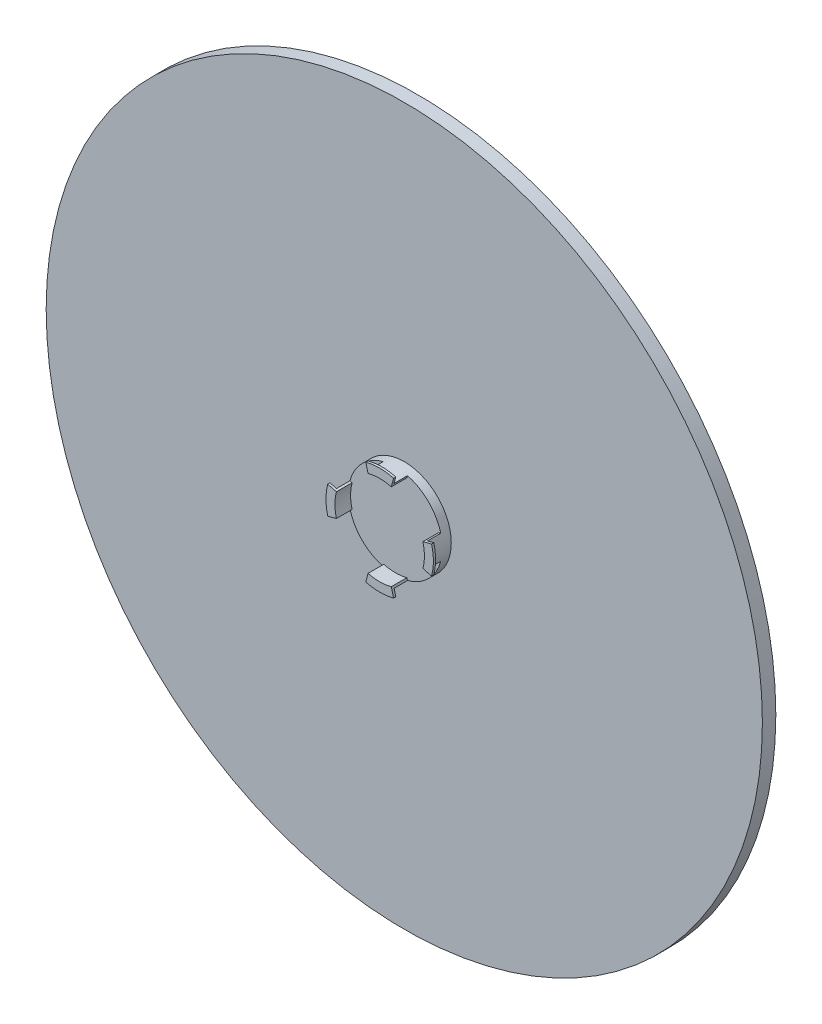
from build123d import *
from build123d.topology import SkipClean

# Parameters (mm, degrees)
ESQUISSE1_R      = 800
EXTRUSION1_DEPTH = 30
ESQUISSE3_R      = 105
EXTRUSION2_DEPTH = 20
EXTRUSION3_DEPTH = 30
EXTRUSION5_DEPTH = 5


with BuildPart() as part:
    # Esquisse1 → Extrusion1 (new body)
    with BuildSketch(Plane.XY):
        Circle(ESQUISSE1_R)
    extrude(amount=EXTRUSION1_DEPTH)

    # Esquisse3 → Extrusion2 (add)
    with BuildSketch(Plane.XY.offset(30)):
        Circle(ESQUISSE3_R)
    extrude(amount=EXTRUSION2_DEPTH)

    # Esquisse4 → Extrusion3 (add)
    with SkipClean():  # the faces are left unmerged after this step: merging them gives an invalid solid
        with BuildSketch(Plane.XY.offset(50)):
            with BuildLine():
                Line((-25.88190451, 96.592582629), (-27.175999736, 101.42221176))
                ThreePointArc((-27.175999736, 101.42221176), (0, 105), (27.175999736, 101.42221176))
                Line((27.175999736, 101.42221176), (25.88190451, 96.592582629))
                ThreePointArc((25.88190451, 96.592582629), (0, 100), (-25.88190451, 96.592582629))
            make_face()
            with BuildLine():
                Line((96.592582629, 25.88190451), (101.42221176, 27.175999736))
                ThreePointArc((101.42221176, 27.175999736), (105, 0), (101.42221176, -27.175999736))
                Line((101.42221176, -27.175999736), (96.592582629, -25.88190451))
                ThreePointArc((96.592582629, -25.88190451), (100, 0), (96.592582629, 25.88190451))
            make_face()
            with BuildLine():
                Line((-25.88190451, -96.592582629), (-27.175999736, -101.42221176))
                ThreePointArc((-27.175999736, -101.42221176), (0, -105), (27.175999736, -101.42221176))
                Line((27.175999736, -101.42221176), (25.88190451, -96.592582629))
                ThreePointArc((25.88190451, -96.592582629), (0, -100), (-25.88190451, -96.592582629))
            make_face()
            with BuildLine():
                Line((-96.592582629, 25.88190451), (-101.42221176, 27.175999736))
                ThreePointArc((-101.42221176, 27.175999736), (-105, 0), (-101.42221176, -27.175999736))
                Line((-101.42221176, -27.175999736), (-96.592582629, -25.88190451))
                ThreePointArc((-96.592582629, -25.88190451), (-100, 0), (-96.592582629, 25.88190451))
            make_face()
        extrude(amount=EXTRUSION3_DEPTH)

    # Esquisse6 → Extrusion5 (add)
    with SkipClean():  # the faces are left unmerged after this step: merging them gives an invalid solid
        with BuildSketch(Plane.XY.offset(80)):
            with BuildLine():
                Line((-25.88190451, 96.592582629), (-31.058285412, 115.911099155))
                ThreePointArc((-31.058285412, 115.911099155), (0, 120), (31.058285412, 115.911099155))
                Line((31.058285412, 115.911099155), (25.88190451, 96.592582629))
                ThreePointArc((25.88190451, 96.592582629), (0, 100), (-25.88190451, 96.592582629))
            make_face()
            with BuildLine():
                Line((96.592582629, 25.88190451), (115.911099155, 31.058285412))
                ThreePointArc((115.911099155, 31.058285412), (120, 0), (115.911099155, -31.058285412))
                Line((115.911099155, -31.058285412), (96.592582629, -25.88190451))
                ThreePointArc((96.592582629, -25.88190451), (100, 0), (96.592582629, 25.88190451))
            make_face()
            with BuildLine():
                Line((-96.592582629, 25.88190451), (-115.911099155, 31.058285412))
                ThreePointArc((-115.911099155, 31.058285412), (-120, 0), (-115.911099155, -31.058285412))
                Line((-115.911099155, -31.058285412), (-96.592582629, -25.88190451))
                ThreePointArc((-96.592582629, -25.88190451), (-100, 0), (-96.592582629, 25.88190451))
            make_face()
            with BuildLine():
                Line((-25.88190451, -96.592582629), (-31.058285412, -115.911099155))
                ThreePointArc((-31.058285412, -115.911099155), (0, -120), (31.058285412, -115.911099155))
                Line((31.058285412, -115.911099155), (25.88190451, -96.592582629))
                ThreePointArc((25.88190451, -96.592582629), (0, -100), (-25.88190451, -96.592582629))
            make_face()
        extrude(amount=EXTRUSION5_DEPTH)


solid = part.part
